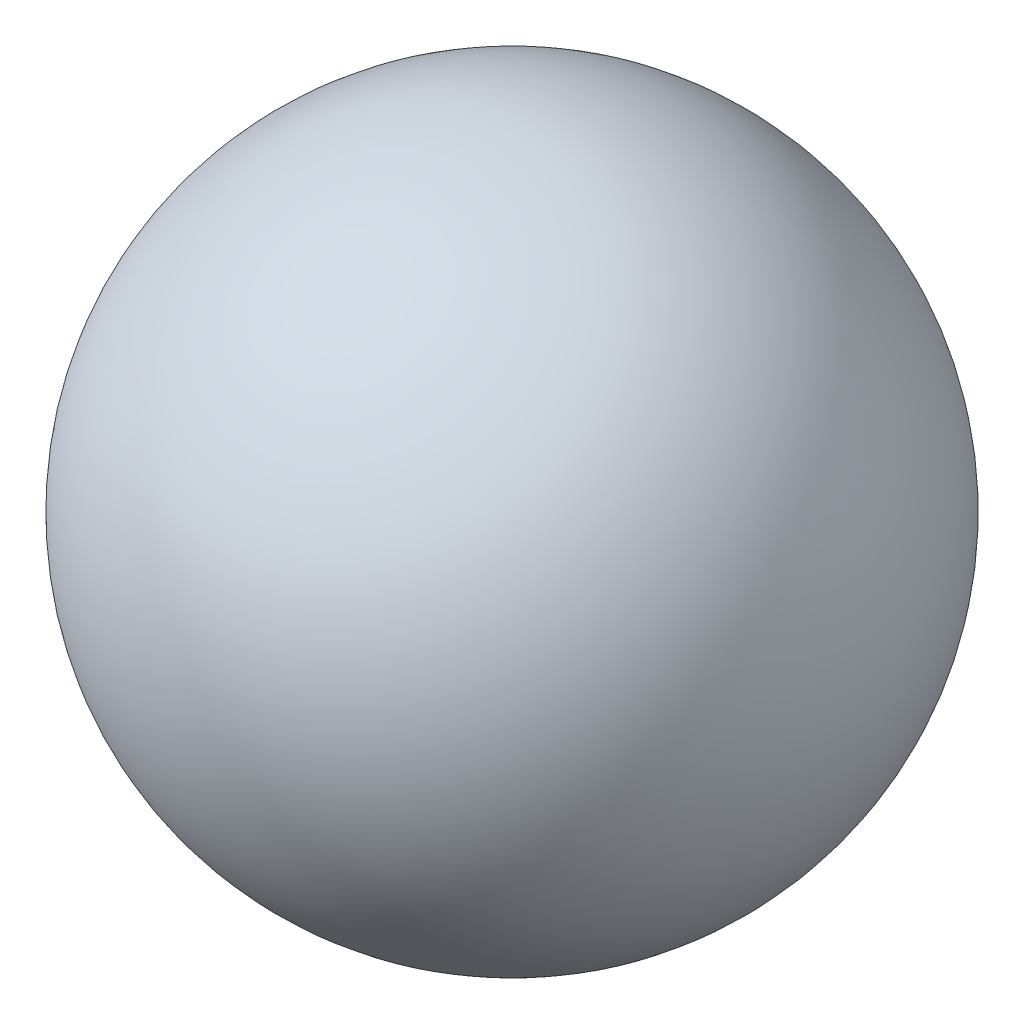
from build123d import *


with BuildPart() as part:
    # Esquisse1 → Base-R_volution (revolve)
    with BuildSketch(Plane.XY):
        with BuildLine():
            Line((0, -2.6), (0, 2.6))
            ThreePointArc((0, 2.6), (-2.6, 0), (0, -2.6))
        make_face()
    revolve(axis=Axis((0, 30, 0), (0, -1, 0)))


solid = part.part
